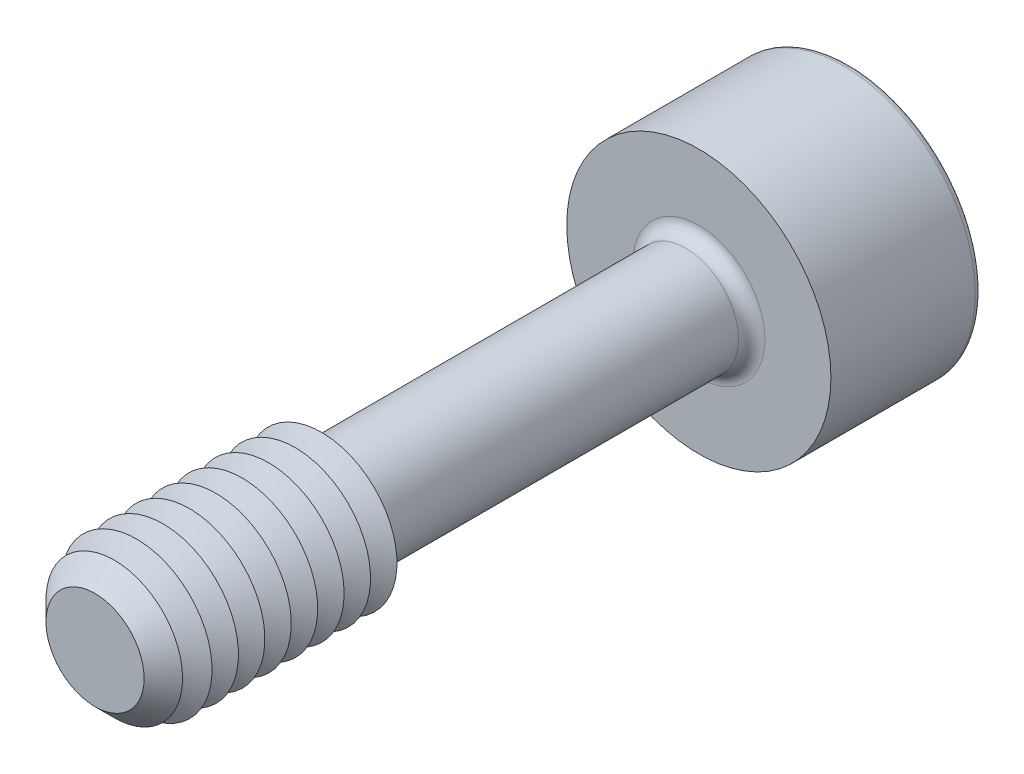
from build123d import *

# Parameters (mm, degrees)
SKETCH1_R       = 1.4
EXTRUDE1_DEPTH  = 8
CHAMFER1_SIZE   = 0.7
SKETCH3_R       = 3.5
EXTRUDE2_DEPTH  = 4
EXTRUDE3_DEPTH  = 3
FILLET1_R       = 0.35
FILLET2_R       = 0.175
LPATTERN1_COUNT = 8
LPATTERN1_PITCH = 0.7


with BuildPart() as part:
    # Sketch1 → Extrude1 (new, symmetric)
    with BuildSketch(Plane.XY):
        Circle(SKETCH1_R)
    extrude(amount=EXTRUDE1_DEPTH, both=True)

    # Sketch2 → Revolve1 (revolve)
    with BuildSketch(Plane(origin=(0, 0, 0), x_dir=(0, 0, -1), z_dir=(1, 0, 0))):
        Polygon((-8, 0), (-8, 2), (-2, 2), (-1.653589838, 1.4), (-1.653589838, 0), align=None)
    revolve(axis=Axis((0, 0, 1.653589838), (0, 0, 1)))

    # Chamfer1
    chamfer1_edges = [part.edges().sort_by_distance(p)[0] for p in [
        (0, -2, 8),
    ]]
    chamfer(chamfer1_edges, length=CHAMFER1_SIZE)

    # Sketch3 → Extrude2 (add)
    with BuildSketch(Plane(origin=(0, 0, -8), x_dir=(-1, 0, 0), z_dir=(0, 0, -1))):
        Circle(SKETCH3_R)
    extrude(amount=EXTRUDE2_DEPTH)

    # Sketch4 → Extrude3 (cut)
    with BuildSketch(Plane(origin=(-13.7, 0, -12), x_dir=(1, 0, 0), z_dir=(0, 0, 1))):
        Polygon((12.833974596, -1.5), (14.566025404, -1.5), (15.432050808, 0), (14.566025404, 1.5), (12.833974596, 1.5), (11.967949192, 0), align=None)
    extrude(amount=EXTRUDE3_DEPTH, mode=Mode.SUBTRACT)

    # Fillet1
    fillet1_edges = [part.edges().sort_by_distance(p)[0] for p in [
        (-1.4, 0, -8),
    ]]
    fillet(fillet1_edges, radius=FILLET1_R)

    # Fillet2
    fillet2_edges = [part.edges().sort_by_distance(p)[0] for p in [
        (3.5, 0, -12),
    ]]
    fillet(fillet2_edges, radius=FILLET2_R)

    # Sketch5 → Cut-Revolve1 (revolve, cut)
    with BuildSketch(Plane(origin=(0, 0, 0), x_dir=(0, 0, -1), z_dir=(1, 0, 0)), mode=Mode.PRIVATE) as cut_revolve1_sk:
        Polygon((9, 0), (9, -1.5), (8.133974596, 0), align=None)
    revolve(cut_revolve1_sk.sketch.rotate(Axis((0, 0, -8.133974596), (0, 0, -1)), 90), axis=Axis((0, 0, -8.133974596), (0, 0, -1)), mode=Mode.SUBTRACT)

    # Sketch7 → Cut-Revolve2 (revolve, cut)
    with BuildSketch(Plane(origin=(0, 0, 0), x_dir=(0, 0, -1), z_dir=(1, 0, 0)), mode=Mode.PRIVATE) as cut_revolve2_sk:
        Polygon((-2, 2), (-2.35, 1.393782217), (-2.7, 2), align=None)
    cut_revolve2 = revolve(cut_revolve2_sk.sketch.rotate(Axis((0, 0, -1.332048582), (0, 0, 1)), 90), axis=Axis((0, 0, -1.332048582), (0, 0, 1)), mode=Mode.SUBTRACT)

    # LPattern1: Cut-Revolve2 ×8
    with Locations(*[(0, 0, i * LPATTERN1_PITCH) for i in range(1, LPATTERN1_COUNT)]):
        add(cut_revolve2, mode=Mode.SUBTRACT)


solid = part.part
